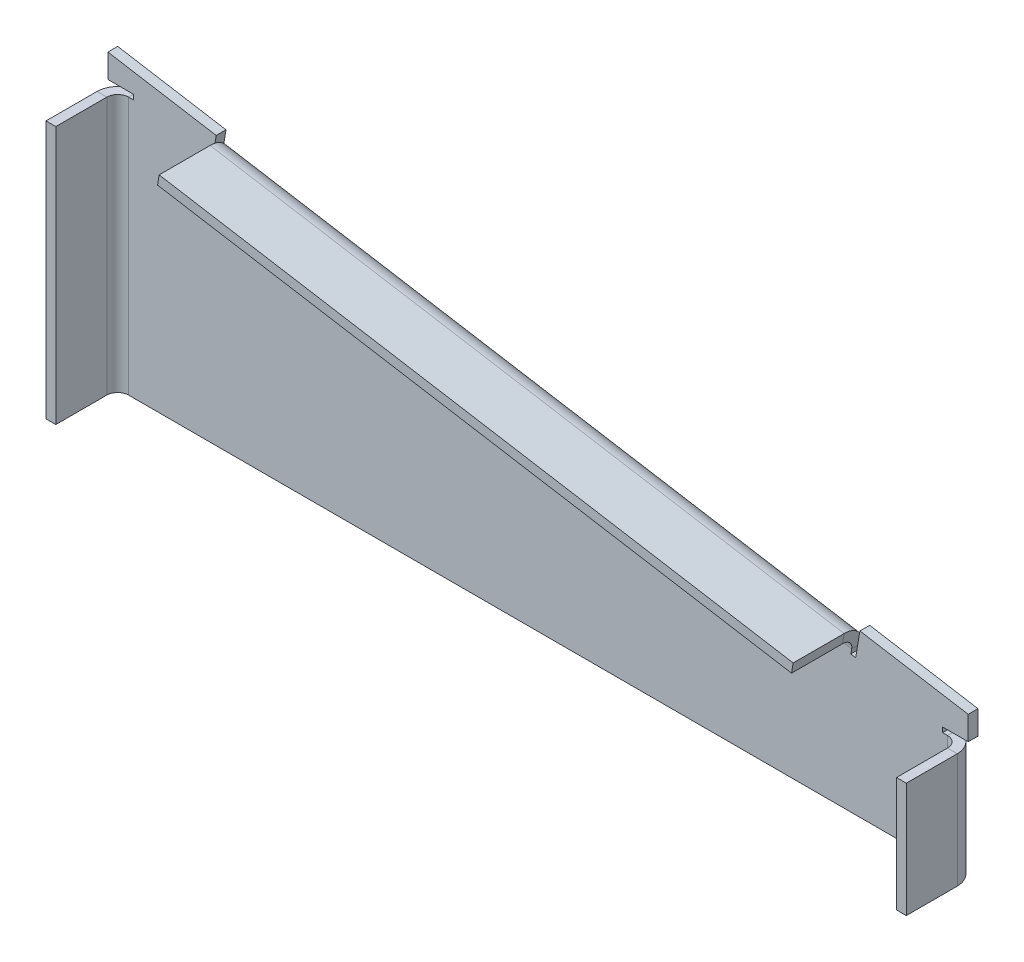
ISO-10303-21;
HEADER;
FILE_DESCRIPTION(('STEP AP214'),'2;1');
FILE_NAME('part.step','',(''),(''),'','','');
FILE_SCHEMA(('AUTOMOTIVE_DESIGN { 1 0 10303 214 1 1 1 1 }'));
ENDSEC;
DATA;
#1=APPLICATION_CONTEXT('core data for automotive mechanical design processes');
#2=APPLICATION_PROTOCOL_DEFINITION('international standard','automotive_design',2000,#1);
#3=PRODUCT_CONTEXT('',#1,'mechanical');
#4=PRODUCT('Part','Part','',(#3));
#5=PRODUCT_RELATED_PRODUCT_CATEGORY('part','',(#4));
#6=PRODUCT_DEFINITION_FORMATION('','',#4);
#7=PRODUCT_DEFINITION_CONTEXT('part definition',#1,'design');
#8=PRODUCT_DEFINITION('design','',#6,#7);
#9=PRODUCT_DEFINITION_SHAPE('','',#8);
#10=(LENGTH_UNIT() NAMED_UNIT(*) SI_UNIT(.MILLI.,.METRE.));
#11=(NAMED_UNIT(*) PLANE_ANGLE_UNIT() SI_UNIT($,.RADIAN.));
#12=(NAMED_UNIT(*) SI_UNIT($,.STERADIAN.) SOLID_ANGLE_UNIT());
#13=UNCERTAINTY_MEASURE_WITH_UNIT(LENGTH_MEASURE(1.E-05),#10,'distance_accuracy_value','');
#14=(GEOMETRIC_REPRESENTATION_CONTEXT(3) GLOBAL_UNCERTAINTY_ASSIGNED_CONTEXT((#13)) GLOBAL_UNIT_ASSIGNED_CONTEXT((#10,
#11,#12)) REPRESENTATION_CONTEXT('',''));
#15=CARTESIAN_POINT('',(0.,0.,0.));
#16=DIRECTION('',(0.,0.,1.));
#17=DIRECTION('',(1.,0.,0.));
#18=AXIS2_PLACEMENT_3D('',#15,#16,#17);
#19=CARTESIAN_POINT('',(0.,0.,3.4163));
#20=DIRECTION('',(0.,0.,-1.));
#21=DIRECTION('',(-1.,0.,0.));
#22=AXIS2_PLACEMENT_3D('',#19,#20,#21);
#23=PLANE('',#22);
#24=DIRECTION('',(-1.,0.,0.));
#25=VECTOR('',#24,1.);
#26=CARTESIAN_POINT('',(300.,41.70815,3.4163));
#27=LINE('',#26,#25);
#28=CARTESIAN_POINT('',(300.,41.70815,3.4163));
#29=VERTEX_POINT('',#28);
#30=CARTESIAN_POINT('',(291.06555,41.70815,3.4163));
#31=VERTEX_POINT('',#30);
#32=EDGE_CURVE('E474',#29,#31,#27,.T.);
#33=ORIENTED_EDGE('',*,*,#32,.F.);
#34=DIRECTION('',(0.,1.,0.));
#35=VECTOR('',#34,1.);
#36=CARTESIAN_POINT('',(300.,0.,3.4163));
#37=LINE('',#36,#35);
#38=CARTESIAN_POINT('',(300.,50.,3.4163));
#39=VERTEX_POINT('',#38);
#40=EDGE_CURVE('E552',#29,#39,#37,.T.);
#41=ORIENTED_EDGE('',*,*,#40,.T.);
#42=DIRECTION('',(-0.986393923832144,0.164398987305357,0.));
#43=VECTOR('',#42,1.);
#44=CARTESIAN_POINT('',(0.,100.,3.4163));
#45=LINE('',#44,#43);
#46=CARTESIAN_POINT('',(262.229151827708,56.2951413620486,3.4163));
#47=VERTEX_POINT('',#46);
#48=EDGE_CURVE('E555',#39,#47,#45,.T.);
#49=ORIENTED_EDGE('',*,*,#48,.T.);
#50=DIRECTION('',(0.164398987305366,0.986393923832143,0.));
#51=VECTOR('',#50,1.);
#52=CARTESIAN_POINT('',(260.760337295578,47.4822541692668,3.41630000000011));
#53=LINE('',#52,#51);
#54=CARTESIAN_POINT('',(260.760337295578,47.4822541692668,3.4163));
#55=VERTEX_POINT('',#54);
#56=EDGE_CURVE('E509',#55,#47,#53,.T.);
#57=ORIENTED_EDGE('',*,*,#56,.F.);
#58=DIRECTION('',(0.986393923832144,-0.164398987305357,0.));
#59=VECTOR('',#58,1.);
#60=CARTESIAN_POINT('',(259.075428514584,47.7630722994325,3.41630000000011));
#61=LINE('',#60,#59);
#62=CARTESIAN_POINT('',(259.075428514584,47.7630722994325,3.4163));
#63=VERTEX_POINT('',#62);
#64=EDGE_CURVE('E505',#63,#55,#61,.T.);
#65=ORIENTED_EDGE('',*,*,#64,.F.);
#66=DIRECTION('',(-0.164398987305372,-0.986393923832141,0.));
#67=VECTOR('',#66,1.);
#68=CARTESIAN_POINT('',(259.35624664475,49.4479810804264,3.41630000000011));
#69=LINE('',#68,#67);
#70=CARTESIAN_POINT('',(259.35624664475,49.4479810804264,3.41630000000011));
#71=VERTEX_POINT('',#70);
#72=EDGE_CURVE('E502',#71,#63,#69,.T.);
#73=ORIENTED_EDGE('',*,*,#72,.F.);
#74=DIRECTION('',(-0.986393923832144,0.164398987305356,0.));
#75=VECTOR('',#74,1.);
#76=CARTESIAN_POINT('',(38.267760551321,86.2960620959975,3.41630000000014));
#77=LINE('',#76,#75);
#78=CARTESIAN_POINT('',(38.267760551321,86.2960620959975,3.41630000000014));
#79=VERTEX_POINT('',#78);
#80=EDGE_CURVE('E411',#79,#71,#77,.F.);
#81=ORIENTED_EDGE('',*,*,#80,.F.);
#82=DIRECTION('',(0.164398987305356,0.986393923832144,0.));
#83=VECTOR('',#82,1.);
#84=CARTESIAN_POINT('',(37.9869424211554,84.6111533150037,3.41630000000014));
#85=LINE('',#84,#83);
#86=CARTESIAN_POINT('',(37.9869424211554,84.6111533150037,3.4163));
#87=VERTEX_POINT('',#86);
#88=EDGE_CURVE('E498',#87,#79,#85,.T.);
#89=ORIENTED_EDGE('',*,*,#88,.F.);
#90=DIRECTION('',(0.986393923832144,-0.164398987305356,0.));
#91=VECTOR('',#90,1.);
#92=CARTESIAN_POINT('',(36.3020336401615,84.8919714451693,3.41630000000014));
#93=LINE('',#92,#91);
#94=CARTESIAN_POINT('',(36.3020336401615,84.8919714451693,3.4163));
#95=VERTEX_POINT('',#94);
#96=EDGE_CURVE('E494',#95,#87,#93,.T.);
#97=ORIENTED_EDGE('',*,*,#96,.F.);
#98=DIRECTION('',(-0.164398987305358,-0.986393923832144,0.));
#99=VECTOR('',#98,1.);
#100=CARTESIAN_POINT('',(37.7708481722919,93.7048586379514,3.41630000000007));
#101=LINE('',#100,#99);
#102=CARTESIAN_POINT('',(37.7708481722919,93.7048586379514,3.4163));
#103=VERTEX_POINT('',#102);
#104=EDGE_CURVE('E489',#103,#95,#101,.T.);
#105=ORIENTED_EDGE('',*,*,#104,.F.);
#106=CARTESIAN_POINT('',(0.,100.,3.4163));
#107=VERTEX_POINT('',#106);
#108=EDGE_CURVE('E554',#103,#107,#45,.T.);
#109=ORIENTED_EDGE('',*,*,#108,.T.);
#110=DIRECTION('',(0.,-1.,0.));
#111=VECTOR('',#110,1.);
#112=CARTESIAN_POINT('',(0.,0.,3.4163));
#113=LINE('',#112,#111);
#114=CARTESIAN_POINT('',(0.,91.70815,3.4163));
#115=VERTEX_POINT('',#114);
#116=EDGE_CURVE('E545',#107,#115,#113,.T.);
#117=ORIENTED_EDGE('',*,*,#116,.T.);
#118=DIRECTION('',(-1.,0.,0.));
#119=VECTOR('',#118,1.);
#120=CARTESIAN_POINT('',(8.93444999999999,91.70815,3.4163));
#121=LINE('',#120,#119);
#122=CARTESIAN_POINT('',(8.93444999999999,91.70815,3.4163));
#123=VERTEX_POINT('',#122);
#124=EDGE_CURVE('E537',#123,#115,#121,.T.);
#125=ORIENTED_EDGE('',*,*,#124,.F.);
#126=DIRECTION('',(0.,1.,0.));
#127=VECTOR('',#126,1.);
#128=CARTESIAN_POINT('',(8.93444999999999,90.,3.4163));
#129=LINE('',#128,#127);
#130=CARTESIAN_POINT('',(8.93444999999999,90.,3.4163));
#131=VERTEX_POINT('',#130);
#132=EDGE_CURVE('E533',#131,#123,#129,.T.);
#133=ORIENTED_EDGE('',*,*,#132,.F.);
#134=DIRECTION('',(1.,0.,0.));
#135=VECTOR('',#134,1.);
#136=CARTESIAN_POINT('',(7.22629999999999,90.,3.4163));
#137=LINE('',#136,#135);
#138=CARTESIAN_POINT('',(7.22629999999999,90.,3.4163));
#139=VERTEX_POINT('',#138);
#140=EDGE_CURVE('E529',#139,#131,#137,.T.);
#141=ORIENTED_EDGE('',*,*,#140,.F.);
#142=DIRECTION('',(0.,-1.,0.));
#143=VECTOR('',#142,1.);
#144=CARTESIAN_POINT('',(7.22629999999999,0.,3.4163));
#145=LINE('',#144,#143);
#146=CARTESIAN_POINT('',(7.22629999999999,0.,3.4163));
#147=VERTEX_POINT('',#146);
#148=EDGE_CURVE('E464',#147,#139,#145,.F.);
#149=ORIENTED_EDGE('',*,*,#148,.F.);
#150=DIRECTION('',(1.,0.,0.));
#151=VECTOR('',#150,1.);
#152=CARTESIAN_POINT('',(0.,0.,3.4163));
#153=LINE('',#152,#151);
#154=CARTESIAN_POINT('',(292.7737,0.,3.41629999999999));
#155=VERTEX_POINT('',#154);
#156=EDGE_CURVE('E548',#147,#155,#153,.T.);
#157=ORIENTED_EDGE('',*,*,#156,.T.);
#158=DIRECTION('',(0.,1.,0.));
#159=VECTOR('',#158,1.);
#160=CARTESIAN_POINT('',(292.7737,40.,3.41629999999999));
#161=LINE('',#160,#159);
#162=CARTESIAN_POINT('',(292.7737,40.,3.41629999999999));
#163=VERTEX_POINT('',#162);
#164=EDGE_CURVE('E357',#163,#155,#161,.F.);
#165=ORIENTED_EDGE('',*,*,#164,.F.);
#166=DIRECTION('',(1.,0.,0.));
#167=VECTOR('',#166,1.);
#168=CARTESIAN_POINT('',(291.06555,40.,3.41629999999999));
#169=LINE('',#168,#167);
#170=CARTESIAN_POINT('',(291.06555,40.,3.4163));
#171=VERTEX_POINT('',#170);
#172=EDGE_CURVE('E114',#171,#163,#169,.T.);
#173=ORIENTED_EDGE('',*,*,#172,.F.);
#174=DIRECTION('',(0.,-1.,0.));
#175=VECTOR('',#174,1.);
#176=CARTESIAN_POINT('',(291.06555,41.70815,3.41629999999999));
#177=LINE('',#176,#175);
#178=EDGE_CURVE('E109',#31,#171,#177,.T.);
#179=ORIENTED_EDGE('',*,*,#178,.F.);
#180=EDGE_LOOP('',(#33,#41,#49,#57,#65,#73,#81,#89,#97,#105,#109,#117,#125,#133,#141,#149,#157,
#165,#173,#179));
#181=FACE_BOUND('',#180,.T.);
#182=ADVANCED_FACE('F94',(#181),#23,.F.);
#183=CARTESIAN_POINT('',(0.,0.,0.));
#184=DIRECTION('',(0.,0.,-1.));
#185=DIRECTION('',(-1.,0.,0.));
#186=AXIS2_PLACEMENT_3D('',#183,#184,#185);
#187=PLANE('',#186);
#188=DIRECTION('',(0.,1.,0.));
#189=VECTOR('',#188,1.);
#190=CARTESIAN_POINT('',(300.,0.,0.));
#191=LINE('',#190,#189);
#192=CARTESIAN_POINT('',(300.,41.70815,0.));
#193=VERTEX_POINT('',#192);
#194=CARTESIAN_POINT('',(300.,50.,0.));
#195=VERTEX_POINT('',#194);
#196=EDGE_CURVE('E564',#193,#195,#191,.T.);
#197=ORIENTED_EDGE('',*,*,#196,.F.);
#198=DIRECTION('',(-1.,0.,0.));
#199=VECTOR('',#198,1.);
#200=CARTESIAN_POINT('',(0.,41.70815,0.));
#201=LINE('',#200,#199);
#202=CARTESIAN_POINT('',(291.06555,41.70815,0.));
#203=VERTEX_POINT('',#202);
#204=EDGE_CURVE('E477',#193,#203,#201,.T.);
#205=ORIENTED_EDGE('',*,*,#204,.T.);
#206=DIRECTION('',(0.,-1.,0.));
#207=VECTOR('',#206,1.);
#208=CARTESIAN_POINT('',(291.06555,0.,0.));
#209=LINE('',#208,#207);
#210=CARTESIAN_POINT('',(291.06555,40.,0.));
#211=VERTEX_POINT('',#210);
#212=EDGE_CURVE('E13',#203,#211,#209,.T.);
#213=ORIENTED_EDGE('',*,*,#212,.T.);
#214=DIRECTION('',(1.,0.,0.));
#215=VECTOR('',#214,1.);
#216=CARTESIAN_POINT('',(0.,40.,0.));
#217=LINE('',#216,#215);
#218=CARTESIAN_POINT('',(292.7737,40.,0.));
#219=VERTEX_POINT('',#218);
#220=EDGE_CURVE('E102',#211,#219,#217,.T.);
#221=ORIENTED_EDGE('',*,*,#220,.T.);
#222=DIRECTION('',(0.,1.,0.));
#223=VECTOR('',#222,1.);
#224=CARTESIAN_POINT('',(292.7737,40.,0.));
#225=LINE('',#224,#223);
#226=CARTESIAN_POINT('',(292.7737,0.,0.));
#227=VERTEX_POINT('',#226);
#228=EDGE_CURVE('E344',#219,#227,#225,.F.);
#229=ORIENTED_EDGE('',*,*,#228,.T.);
#230=DIRECTION('',(1.,0.,0.));
#231=VECTOR('',#230,1.);
#232=CARTESIAN_POINT('',(0.,0.,0.));
#233=LINE('',#232,#231);
#234=CARTESIAN_POINT('',(7.22629999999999,0.,0.));
#235=VERTEX_POINT('',#234);
#236=EDGE_CURVE('E561',#235,#227,#233,.T.);
#237=ORIENTED_EDGE('',*,*,#236,.F.);
#238=DIRECTION('',(0.,-1.,0.));
#239=VECTOR('',#238,1.);
#240=CARTESIAN_POINT('',(7.22629999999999,0.,0.));
#241=LINE('',#240,#239);
#242=CARTESIAN_POINT('',(7.22629999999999,90.,0.));
#243=VERTEX_POINT('',#242);
#244=EDGE_CURVE('E451',#235,#243,#241,.F.);
#245=ORIENTED_EDGE('',*,*,#244,.T.);
#246=DIRECTION('',(1.,0.,0.));
#247=VECTOR('',#246,1.);
#248=CARTESIAN_POINT('',(0.,90.,0.));
#249=LINE('',#248,#247);
#250=CARTESIAN_POINT('',(8.93444999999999,90.,0.));
#251=VERTEX_POINT('',#250);
#252=EDGE_CURVE('E579',#243,#251,#249,.T.);
#253=ORIENTED_EDGE('',*,*,#252,.T.);
#254=DIRECTION('',(0.,1.,0.));
#255=VECTOR('',#254,1.);
#256=CARTESIAN_POINT('',(8.93444999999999,0.,0.));
#257=LINE('',#256,#255);
#258=CARTESIAN_POINT('',(8.93444999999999,91.70815,0.));
#259=VERTEX_POINT('',#258);
#260=EDGE_CURVE('E576',#251,#259,#257,.T.);
#261=ORIENTED_EDGE('',*,*,#260,.T.);
#262=DIRECTION('',(-1.,0.,0.));
#263=VECTOR('',#262,1.);
#264=CARTESIAN_POINT('',(0.,91.70815,0.));
#265=LINE('',#264,#263);
#266=CARTESIAN_POINT('',(0.,91.70815,0.));
#267=VERTEX_POINT('',#266);
#268=EDGE_CURVE('E573',#259,#267,#265,.T.);
#269=ORIENTED_EDGE('',*,*,#268,.T.);
#270=DIRECTION('',(0.,-1.,0.));
#271=VECTOR('',#270,1.);
#272=CARTESIAN_POINT('',(0.,0.,0.));
#273=LINE('',#272,#271);
#274=CARTESIAN_POINT('',(0.,100.,0.));
#275=VERTEX_POINT('',#274);
#276=EDGE_CURVE('E532',#275,#267,#273,.T.);
#277=ORIENTED_EDGE('',*,*,#276,.F.);
#278=DIRECTION('',(-0.986393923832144,0.164398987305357,0.));
#279=VECTOR('',#278,1.);
#280=CARTESIAN_POINT('',(0.,100.,0.));
#281=LINE('',#280,#279);
#282=CARTESIAN_POINT('',(37.7708481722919,93.7048586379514,0.));
#283=VERTEX_POINT('',#282);
#284=EDGE_CURVE('E566',#283,#275,#281,.T.);
#285=ORIENTED_EDGE('',*,*,#284,.F.);
#286=DIRECTION('',(-0.164398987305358,-0.986393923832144,0.));
#287=VECTOR('',#286,1.);
#288=CARTESIAN_POINT('',(21.5546319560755,-3.59243865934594,0.));
#289=LINE('',#288,#287);
#290=CARTESIAN_POINT('',(36.3020336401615,84.8919714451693,0.));
#291=VERTEX_POINT('',#290);
#292=EDGE_CURVE('E526',#283,#291,#289,.T.);
#293=ORIENTED_EDGE('',*,*,#292,.T.);
#294=DIRECTION('',(0.986393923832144,-0.164398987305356,0.));
#295=VECTOR('',#294,1.);
#296=CARTESIAN_POINT('',(14.7474016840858,88.4844101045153,0.));
#297=LINE('',#296,#295);
#298=CARTESIAN_POINT('',(37.9869424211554,84.6111533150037,0.));
#299=VERTEX_POINT('',#298);
#300=EDGE_CURVE('E589',#291,#299,#297,.T.);
#301=ORIENTED_EDGE('',*,*,#300,.T.);
#302=DIRECTION('',(0.164398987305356,0.986393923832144,0.));
#303=VECTOR('',#302,1.);
#304=CARTESIAN_POINT('',(23.2395407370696,-3.87325678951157,0.));
#305=LINE('',#304,#303);
#306=CARTESIAN_POINT('',(38.267760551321,86.2960620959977,1.37043154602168E-13));
#307=VERTEX_POINT('',#306);
#308=EDGE_CURVE('E586',#299,#307,#305,.T.);
#309=ORIENTED_EDGE('',*,*,#308,.T.);
#310=DIRECTION('',(-0.986393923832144,0.164398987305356,0.));
#311=VECTOR('',#310,1.);
#312=CARTESIAN_POINT('',(38.267760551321,86.2960620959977,1.37043154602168E-13));
#313=LINE('',#312,#311);
#314=CARTESIAN_POINT('',(259.35624664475,49.4479810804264,0.));
#315=VERTEX_POINT('',#314);
#316=EDGE_CURVE('E398',#307,#315,#313,.F.);
#317=ORIENTED_EDGE('',*,*,#316,.T.);
#318=DIRECTION('',(-0.164398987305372,-0.986393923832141,0.));
#319=VECTOR('',#318,1.);
#320=CARTESIAN_POINT('',(244.328026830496,-40.7213378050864,0.));
#321=LINE('',#320,#319);
#322=CARTESIAN_POINT('',(259.075428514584,47.7630722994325,0.));
#323=VERTEX_POINT('',#322);
#324=EDGE_CURVE('E584',#315,#323,#321,.T.);
#325=ORIENTED_EDGE('',*,*,#324,.T.);
#326=DIRECTION('',(0.986393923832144,-0.164398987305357,0.));
#327=VECTOR('',#326,1.);
#328=CARTESIAN_POINT('',(14.7474016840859,88.4844101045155,0.));
#329=LINE('',#328,#327);
#330=CARTESIAN_POINT('',(260.760337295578,47.4822541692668,0.));
#331=VERTEX_POINT('',#330);
#332=EDGE_CURVE('E582',#323,#331,#329,.T.);
#333=ORIENTED_EDGE('',*,*,#332,.T.);
#334=DIRECTION('',(0.164398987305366,0.986393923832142,0.));
#335=VECTOR('',#334,1.);
#336=CARTESIAN_POINT('',(246.012935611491,-41.0021559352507,0.));
#337=LINE('',#336,#335);
#338=CARTESIAN_POINT('',(262.229151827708,56.2951413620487,0.));
#339=VERTEX_POINT('',#338);
#340=EDGE_CURVE('E492',#331,#339,#337,.T.);
#341=ORIENTED_EDGE('',*,*,#340,.T.);
#342=EDGE_CURVE('E549',#195,#339,#281,.T.);
#343=ORIENTED_EDGE('',*,*,#342,.F.);
#344=EDGE_LOOP('',(#197,#205,#213,#221,#229,#237,#245,#253,#261,#269,#277,#285,#293,#301,#309,
#317,#325,#333,#341,#343));
#345=FACE_BOUND('',#344,.T.);
#346=ADVANCED_FACE('F594',(#345),#187,.T.);
#347=CARTESIAN_POINT('',(0.,0.,3.4163));
#348=DIRECTION('',(0.,1.,0.));
#349=DIRECTION('',(0.,0.,1.));
#350=AXIS2_PLACEMENT_3D('',#347,#348,#349);
#351=PLANE('',#350);
#352=DIRECTION('',(0.,0.,-1.));
#353=VECTOR('',#352,1.);
#354=CARTESIAN_POINT('',(292.7737,0.,3.41629999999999));
#355=LINE('',#354,#353);
#356=EDGE_CURVE('E362',#155,#227,#355,.T.);
#357=ORIENTED_EDGE('',*,*,#356,.F.);
#358=ORIENTED_EDGE('',*,*,#156,.F.);
#359=DIRECTION('',(0.,0.,-1.));
#360=VECTOR('',#359,1.);
#361=CARTESIAN_POINT('',(7.22629999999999,0.,3.4163));
#362=LINE('',#361,#360);
#363=EDGE_CURVE('E458',#147,#235,#362,.T.);
#364=ORIENTED_EDGE('',*,*,#363,.T.);
#365=ORIENTED_EDGE('',*,*,#236,.T.);
#366=EDGE_LOOP('',(#357,#358,#364,#365));
#367=FACE_BOUND('',#366,.T.);
#368=ADVANCED_FACE('F612',(#367),#351,.F.);
#369=CARTESIAN_POINT('',(300.,0.,3.4163));
#370=DIRECTION('',(-1.,0.,0.));
#371=DIRECTION('',(0.,0.,1.));
#372=AXIS2_PLACEMENT_3D('',#369,#370,#371);
#373=PLANE('',#372);
#374=DIRECTION('',(0.,0.,-1.));
#375=VECTOR('',#374,1.);
#376=CARTESIAN_POINT('',(300.,41.70815,3.4163));
#377=LINE('',#376,#375);
#378=EDGE_CURVE('E478',#29,#193,#377,.T.);
#379=ORIENTED_EDGE('',*,*,#378,.T.);
#380=ORIENTED_EDGE('',*,*,#196,.T.);
#381=DIRECTION('',(0.,0.,-1.));
#382=VECTOR('',#381,1.);
#383=CARTESIAN_POINT('',(300.,50.,3.4163));
#384=LINE('',#383,#382);
#385=EDGE_CURVE('E570',#39,#195,#384,.T.);
#386=ORIENTED_EDGE('',*,*,#385,.F.);
#387=ORIENTED_EDGE('',*,*,#40,.F.);
#388=EDGE_LOOP('',(#379,#380,#386,#387));
#389=FACE_BOUND('',#388,.T.);
#390=ADVANCED_FACE('F646',(#389),#373,.F.);
#391=CARTESIAN_POINT('',(0.,100.,3.4163));
#392=DIRECTION('',(-0.164398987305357,-0.986393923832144,0.));
#393=DIRECTION('',(0.986393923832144,-0.164398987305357,0.));
#394=AXIS2_PLACEMENT_3D('',#391,#392,#393);
#395=PLANE('',#394);
#396=DIRECTION('',(0.,0.,-1.));
#397=VECTOR('',#396,1.);
#398=CARTESIAN_POINT('',(37.7708481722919,93.7048586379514,3.41630000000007));
#399=LINE('',#398,#397);
#400=EDGE_CURVE('E493',#103,#283,#399,.T.);
#401=ORIENTED_EDGE('',*,*,#400,.T.);
#402=ORIENTED_EDGE('',*,*,#284,.T.);
#403=DIRECTION('',(0.,0.,-1.));
#404=VECTOR('',#403,1.);
#405=CARTESIAN_POINT('',(0.,100.,3.4163));
#406=LINE('',#405,#404);
#407=EDGE_CURVE('E558',#107,#275,#406,.T.);
#408=ORIENTED_EDGE('',*,*,#407,.F.);
#409=ORIENTED_EDGE('',*,*,#108,.F.);
#410=EDGE_LOOP('',(#401,#402,#408,#409));
#411=FACE_BOUND('',#410,.T.);
#412=ADVANCED_FACE('F642',(#411),#395,.F.);
#413=DIRECTION('',(0.,0.,-1.));
#414=VECTOR('',#413,1.);
#415=CARTESIAN_POINT('',(262.229151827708,56.2951413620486,3.41630000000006));
#416=LINE('',#415,#414);
#417=EDGE_CURVE('E512',#47,#339,#416,.T.);
#418=ORIENTED_EDGE('',*,*,#417,.F.);
#419=ORIENTED_EDGE('',*,*,#48,.F.);
#420=ORIENTED_EDGE('',*,*,#385,.T.);
#421=ORIENTED_EDGE('',*,*,#342,.T.);
#422=EDGE_LOOP('',(#418,#419,#420,#421));
#423=FACE_BOUND('',#422,.T.);
#424=ADVANCED_FACE('F645',(#423),#395,.F.);
#425=CARTESIAN_POINT('',(0.,0.,3.4163));
#426=DIRECTION('',(1.,0.,0.));
#427=DIRECTION('',(0.,0.,-1.));
#428=AXIS2_PLACEMENT_3D('',#425,#426,#427);
#429=PLANE('',#428);
#430=DIRECTION('',(0.,0.,-1.));
#431=VECTOR('',#430,1.);
#432=CARTESIAN_POINT('',(0.,91.70815,3.4163));
#433=LINE('',#432,#431);
#434=EDGE_CURVE('E539',#115,#267,#433,.T.);
#435=ORIENTED_EDGE('',*,*,#434,.F.);
#436=ORIENTED_EDGE('',*,*,#116,.F.);
#437=ORIENTED_EDGE('',*,*,#407,.T.);
#438=ORIENTED_EDGE('',*,*,#276,.T.);
#439=EDGE_LOOP('',(#435,#436,#437,#438));
#440=FACE_BOUND('',#439,.T.);
#441=ADVANCED_FACE('F96',(#440),#429,.F.);
#442=CARTESIAN_POINT('',(7.22629999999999,90.,3.4163));
#443=DIRECTION('',(0.,1.,0.));
#444=DIRECTION('',(0.,0.,1.));
#445=AXIS2_PLACEMENT_3D('',#442,#443,#444);
#446=PLANE('',#445);
#447=ORIENTED_EDGE('',*,*,#252,.F.);
#448=DIRECTION('',(0.,0.,-1.));
#449=VECTOR('',#448,1.);
#450=CARTESIAN_POINT('',(7.22629999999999,90.,3.4163));
#451=LINE('',#450,#449);
#452=EDGE_CURVE('E468',#139,#243,#451,.T.);
#453=ORIENTED_EDGE('',*,*,#452,.F.);
#454=ORIENTED_EDGE('',*,*,#140,.T.);
#455=DIRECTION('',(0.,0.,-1.));
#456=VECTOR('',#455,1.);
#457=CARTESIAN_POINT('',(8.93444999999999,90.,3.4163));
#458=LINE('',#457,#456);
#459=EDGE_CURVE('E536',#131,#251,#458,.T.);
#460=ORIENTED_EDGE('',*,*,#459,.T.);
#461=EDGE_LOOP('',(#447,#453,#454,#460));
#462=FACE_BOUND('',#461,.T.);
#463=ADVANCED_FACE('F639',(#462),#446,.T.);
#464=CARTESIAN_POINT('',(8.93444999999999,90.,3.4163));
#465=DIRECTION('',(-1.,0.,0.));
#466=DIRECTION('',(0.,0.,1.));
#467=AXIS2_PLACEMENT_3D('',#464,#465,#466);
#468=PLANE('',#467);
#469=ORIENTED_EDGE('',*,*,#260,.F.);
#470=ORIENTED_EDGE('',*,*,#459,.F.);
#471=ORIENTED_EDGE('',*,*,#132,.T.);
#472=DIRECTION('',(0.,0.,-1.));
#473=VECTOR('',#472,1.);
#474=CARTESIAN_POINT('',(8.93444999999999,91.70815,3.4163));
#475=LINE('',#474,#473);
#476=EDGE_CURVE('E528',#123,#259,#475,.T.);
#477=ORIENTED_EDGE('',*,*,#476,.T.);
#478=EDGE_LOOP('',(#469,#470,#471,#477));
#479=FACE_BOUND('',#478,.T.);
#480=ADVANCED_FACE('F681',(#479),#468,.T.);
#481=CARTESIAN_POINT('',(8.93444999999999,91.70815,3.4163));
#482=DIRECTION('',(0.,-1.,0.));
#483=DIRECTION('',(0.,0.,-1.));
#484=AXIS2_PLACEMENT_3D('',#481,#482,#483);
#485=PLANE('',#484);
#486=ORIENTED_EDGE('',*,*,#268,.F.);
#487=ORIENTED_EDGE('',*,*,#476,.F.);
#488=ORIENTED_EDGE('',*,*,#124,.T.);
#489=ORIENTED_EDGE('',*,*,#434,.T.);
#490=EDGE_LOOP('',(#486,#487,#488,#489));
#491=FACE_BOUND('',#490,.T.);
#492=ADVANCED_FACE('F688',(#491),#485,.T.);
#493=CARTESIAN_POINT('',(37.7708481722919,93.7048586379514,3.41630000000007));
#494=DIRECTION('',(0.986393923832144,-0.164398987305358,0.));
#495=DIRECTION('',(0.164398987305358,0.986393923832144,0.));
#496=AXIS2_PLACEMENT_3D('',#493,#494,#495);
#497=PLANE('',#496);
#498=ORIENTED_EDGE('',*,*,#292,.F.);
#499=ORIENTED_EDGE('',*,*,#400,.F.);
#500=ORIENTED_EDGE('',*,*,#104,.T.);
#501=DIRECTION('',(0.,0.,-1.));
#502=VECTOR('',#501,1.);
#503=CARTESIAN_POINT('',(36.3020336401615,84.8919714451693,3.41630000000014));
#504=LINE('',#503,#502);
#505=EDGE_CURVE('E497',#95,#291,#504,.T.);
#506=ORIENTED_EDGE('',*,*,#505,.T.);
#507=EDGE_LOOP('',(#498,#499,#500,#506));
#508=FACE_BOUND('',#507,.T.);
#509=ADVANCED_FACE('F695',(#508),#497,.T.);
#510=CARTESIAN_POINT('',(36.3020336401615,84.8919714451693,3.41630000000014));
#511=DIRECTION('',(0.164398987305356,0.986393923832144,0.));
#512=DIRECTION('',(-0.986393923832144,0.164398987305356,0.));
#513=AXIS2_PLACEMENT_3D('',#510,#511,#512);
#514=PLANE('',#513);
#515=ORIENTED_EDGE('',*,*,#300,.F.);
#516=ORIENTED_EDGE('',*,*,#505,.F.);
#517=ORIENTED_EDGE('',*,*,#96,.T.);
#518=DIRECTION('',(0.,0.,-1.));
#519=VECTOR('',#518,1.);
#520=CARTESIAN_POINT('',(37.9869424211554,84.6111533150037,3.41630000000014));
#521=LINE('',#520,#519);
#522=EDGE_CURVE('E501',#87,#299,#521,.T.);
#523=ORIENTED_EDGE('',*,*,#522,.T.);
#524=EDGE_LOOP('',(#515,#516,#517,#523));
#525=FACE_BOUND('',#524,.T.);
#526=ADVANCED_FACE('F703',(#525),#514,.T.);
#527=CARTESIAN_POINT('',(37.9869424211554,84.6111533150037,3.41630000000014));
#528=DIRECTION('',(-0.986393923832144,0.164398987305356,0.));
#529=DIRECTION('',(-0.164398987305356,-0.986393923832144,0.));
#530=AXIS2_PLACEMENT_3D('',#527,#528,#529);
#531=PLANE('',#530);
#532=ORIENTED_EDGE('',*,*,#308,.F.);
#533=ORIENTED_EDGE('',*,*,#522,.F.);
#534=ORIENTED_EDGE('',*,*,#88,.T.);
#535=DIRECTION('',(0.,0.,-1.));
#536=VECTOR('',#535,1.);
#537=CARTESIAN_POINT('',(38.267760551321,86.2960620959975,3.41630000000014));
#538=LINE('',#537,#536);
#539=EDGE_CURVE('E405',#79,#307,#538,.T.);
#540=ORIENTED_EDGE('',*,*,#539,.T.);
#541=EDGE_LOOP('',(#532,#533,#534,#540));
#542=FACE_BOUND('',#541,.T.);
#543=ADVANCED_FACE('F711',(#542),#531,.T.);
#544=CARTESIAN_POINT('',(259.35624664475,49.4479810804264,3.41630000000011));
#545=DIRECTION('',(0.986393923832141,-0.164398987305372,0.));
#546=DIRECTION('',(0.164398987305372,0.986393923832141,0.));
#547=AXIS2_PLACEMENT_3D('',#544,#545,#546);
#548=PLANE('',#547);
#549=ORIENTED_EDGE('',*,*,#324,.F.);
#550=DIRECTION('',(0.,0.,-1.));
#551=VECTOR('',#550,1.);
#552=CARTESIAN_POINT('',(259.35624664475,49.4479810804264,3.41630000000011));
#553=LINE('',#552,#551);
#554=EDGE_CURVE('E415',#71,#315,#553,.T.);
#555=ORIENTED_EDGE('',*,*,#554,.F.);
#556=ORIENTED_EDGE('',*,*,#72,.T.);
#557=DIRECTION('',(0.,0.,-1.));
#558=VECTOR('',#557,1.);
#559=CARTESIAN_POINT('',(259.075428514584,47.7630722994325,3.41630000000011));
#560=LINE('',#559,#558);
#561=EDGE_CURVE('E508',#63,#323,#560,.T.);
#562=ORIENTED_EDGE('',*,*,#561,.T.);
#563=EDGE_LOOP('',(#549,#555,#556,#562));
#564=FACE_BOUND('',#563,.T.);
#565=ADVANCED_FACE('F719',(#564),#548,.T.);
#566=CARTESIAN_POINT('',(259.075428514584,47.7630722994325,3.41630000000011));
#567=DIRECTION('',(0.164398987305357,0.986393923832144,0.));
#568=DIRECTION('',(-0.986393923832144,0.164398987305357,0.));
#569=AXIS2_PLACEMENT_3D('',#566,#567,#568);
#570=PLANE('',#569);
#571=ORIENTED_EDGE('',*,*,#332,.F.);
#572=ORIENTED_EDGE('',*,*,#561,.F.);
#573=ORIENTED_EDGE('',*,*,#64,.T.);
#574=DIRECTION('',(0.,0.,-1.));
#575=VECTOR('',#574,1.);
#576=CARTESIAN_POINT('',(260.760337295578,47.4822541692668,3.41630000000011));
#577=LINE('',#576,#575);
#578=EDGE_CURVE('E488',#55,#331,#577,.T.);
#579=ORIENTED_EDGE('',*,*,#578,.T.);
#580=EDGE_LOOP('',(#571,#572,#573,#579));
#581=FACE_BOUND('',#580,.T.);
#582=ADVANCED_FACE('F727',(#581),#570,.T.);
#583=CARTESIAN_POINT('',(260.760337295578,47.4822541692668,3.41630000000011));
#584=DIRECTION('',(-0.986393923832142,0.164398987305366,0.));
#585=DIRECTION('',(-0.164398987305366,-0.986393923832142,0.));
#586=AXIS2_PLACEMENT_3D('',#583,#584,#585);
#587=PLANE('',#586);
#588=ORIENTED_EDGE('',*,*,#340,.F.);
#589=ORIENTED_EDGE('',*,*,#578,.F.);
#590=ORIENTED_EDGE('',*,*,#56,.T.);
#591=ORIENTED_EDGE('',*,*,#417,.T.);
#592=EDGE_LOOP('',(#588,#589,#590,#591));
#593=FACE_BOUND('',#592,.T.);
#594=ADVANCED_FACE('F735',(#593),#587,.T.);
#595=CARTESIAN_POINT('',(300.,41.70815,3.4163));
#596=DIRECTION('',(0.,-1.,0.));
#597=DIRECTION('',(0.,0.,-1.));
#598=AXIS2_PLACEMENT_3D('',#595,#596,#597);
#599=PLANE('',#598);
#600=ORIENTED_EDGE('',*,*,#204,.F.);
#601=ORIENTED_EDGE('',*,*,#378,.F.);
#602=ORIENTED_EDGE('',*,*,#32,.T.);
#603=DIRECTION('',(0.,0.,-1.));
#604=VECTOR('',#603,1.);
#605=CARTESIAN_POINT('',(291.06555,41.70815,3.41629999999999));
#606=LINE('',#605,#604);
#607=EDGE_CURVE('E480',#31,#203,#606,.T.);
#608=ORIENTED_EDGE('',*,*,#607,.T.);
#609=EDGE_LOOP('',(#600,#601,#602,#608));
#610=FACE_BOUND('',#609,.T.);
#611=ADVANCED_FACE('F743',(#610),#599,.T.);
#612=CARTESIAN_POINT('',(291.06555,41.70815,3.41629999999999));
#613=DIRECTION('',(1.,0.,0.));
#614=DIRECTION('',(0.,0.,-1.));
#615=AXIS2_PLACEMENT_3D('',#612,#613,#614);
#616=PLANE('',#615);
#617=ORIENTED_EDGE('',*,*,#212,.F.);
#618=ORIENTED_EDGE('',*,*,#607,.F.);
#619=ORIENTED_EDGE('',*,*,#178,.T.);
#620=DIRECTION('',(0.,0.,-1.));
#621=VECTOR('',#620,1.);
#622=CARTESIAN_POINT('',(291.06555,40.,3.41629999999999));
#623=LINE('',#622,#621);
#624=EDGE_CURVE('E471',#171,#211,#623,.T.);
#625=ORIENTED_EDGE('',*,*,#624,.T.);
#626=EDGE_LOOP('',(#617,#618,#619,#625));
#627=FACE_BOUND('',#626,.T.);
#628=ADVANCED_FACE('F751',(#627),#616,.T.);
#629=CARTESIAN_POINT('',(291.06555,40.,3.41629999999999));
#630=DIRECTION('',(0.,1.,0.));
#631=DIRECTION('',(0.,0.,1.));
#632=AXIS2_PLACEMENT_3D('',#629,#630,#631);
#633=PLANE('',#632);
#634=ORIENTED_EDGE('',*,*,#220,.F.);
#635=ORIENTED_EDGE('',*,*,#624,.F.);
#636=ORIENTED_EDGE('',*,*,#172,.T.);
#637=DIRECTION('',(0.,0.,-1.));
#638=VECTOR('',#637,1.);
#639=CARTESIAN_POINT('',(292.7737,40.,3.41629999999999));
#640=LINE('',#639,#638);
#641=EDGE_CURVE('E351',#163,#219,#640,.T.);
#642=ORIENTED_EDGE('',*,*,#641,.T.);
#643=EDGE_LOOP('',(#634,#635,#636,#642));
#644=FACE_BOUND('',#643,.T.);
#645=ADVANCED_FACE('F598',(#644),#633,.T.);
#646=CARTESIAN_POINT('',(7.22629999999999,90.,7.2263));
#647=DIRECTION('',(0.,1.,0.));
#648=DIRECTION('',(0.,0.,1.));
#649=AXIS2_PLACEMENT_3D('',#646,#647,#648);
#650=PLANE('',#649);
#651=DIRECTION('',(1.,0.,0.));
#652=VECTOR('',#651,1.);
#653=CARTESIAN_POINT('',(0.,90.,7.22629999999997));
#654=LINE('',#653,#652);
#655=CARTESIAN_POINT('',(3.41629999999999,90.,7.22629999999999));
#656=VERTEX_POINT('',#655);
#657=CARTESIAN_POINT('',(0.,90.,7.22629999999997));
#658=VERTEX_POINT('',#657);
#659=EDGE_CURVE('E418',#656,#658,#654,.F.);
#660=ORIENTED_EDGE('',*,*,#659,.F.);
#661=CARTESIAN_POINT('',(7.22629999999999,90.,7.2263));
#662=DIRECTION('',(0.,-1.,0.));
#663=DIRECTION('',(0.,0.,-1.));
#664=AXIS2_PLACEMENT_3D('',#661,#662,#663);
#665=CIRCLE('',#664,3.81);
#666=EDGE_CURVE('E461',#139,#656,#665,.F.);
#667=ORIENTED_EDGE('',*,*,#666,.F.);
#668=ORIENTED_EDGE('',*,*,#452,.T.);
#669=CARTESIAN_POINT('',(7.22629999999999,90.,7.2263));
#670=DIRECTION('',(0.,-1.,0.));
#671=DIRECTION('',(0.,0.,-1.));
#672=AXIS2_PLACEMENT_3D('',#669,#670,#671);
#673=CIRCLE('',#672,7.2263);
#674=EDGE_CURVE('E454',#243,#658,#673,.F.);
#675=ORIENTED_EDGE('',*,*,#674,.T.);
#676=EDGE_LOOP('',(#660,#667,#668,#675));
#677=FACE_BOUND('',#676,.T.);
#678=ADVANCED_FACE('F766',(#677),#650,.T.);
#679=CARTESIAN_POINT('',(7.22629999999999,0.,7.2263));
#680=DIRECTION('',(0.,1.,0.));
#681=DIRECTION('',(0.,0.,1.));
#682=AXIS2_PLACEMENT_3D('',#679,#680,#681);
#683=PLANE('',#682);
#684=CARTESIAN_POINT('',(7.22629999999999,0.,7.2263));
#685=DIRECTION('',(0.,-1.,0.));
#686=DIRECTION('',(0.,0.,-1.));
#687=AXIS2_PLACEMENT_3D('',#684,#685,#686);
#688=CIRCLE('',#687,3.81);
#689=CARTESIAN_POINT('',(3.41629999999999,0.,7.22629999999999));
#690=VERTEX_POINT('',#689);
#691=EDGE_CURVE('E424',#690,#147,#688,.T.);
#692=ORIENTED_EDGE('',*,*,#691,.F.);
#693=DIRECTION('',(1.,0.,0.));
#694=VECTOR('',#693,1.);
#695=CARTESIAN_POINT('',(3.41629999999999,0.,7.22629999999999));
#696=LINE('',#695,#694);
#697=CARTESIAN_POINT('',(0.,0.,7.22629999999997));
#698=VERTEX_POINT('',#697);
#699=EDGE_CURVE('E444',#690,#698,#696,.F.);
#700=ORIENTED_EDGE('',*,*,#699,.T.);
#701=CARTESIAN_POINT('',(7.22629999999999,0.,7.2263));
#702=DIRECTION('',(0.,-1.,0.));
#703=DIRECTION('',(0.,0.,-1.));
#704=AXIS2_PLACEMENT_3D('',#701,#702,#703);
#705=CIRCLE('',#704,7.2263);
#706=EDGE_CURVE('E455',#698,#235,#705,.T.);
#707=ORIENTED_EDGE('',*,*,#706,.T.);
#708=ORIENTED_EDGE('',*,*,#363,.F.);
#709=EDGE_LOOP('',(#692,#700,#707,#708));
#710=FACE_BOUND('',#709,.T.);
#711=ADVANCED_FACE('F773',(#710),#683,.F.);
#712=CARTESIAN_POINT('',(7.22629999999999,0.,7.2263));
#713=DIRECTION('',(0.,-1.,0.));
#714=DIRECTION('',(-1.,0.,0.));
#715=AXIS2_PLACEMENT_3D('',#712,#713,#714);
#716=CYLINDRICAL_SURFACE('',#715,7.2263);
#717=ORIENTED_EDGE('',*,*,#244,.F.);
#718=ORIENTED_EDGE('',*,*,#706,.F.);
#719=DIRECTION('',(0.,-1.,0.));
#720=VECTOR('',#719,1.);
#721=CARTESIAN_POINT('',(0.,90.,7.22629999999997));
#722=LINE('',#721,#720);
#723=EDGE_CURVE('E442',#698,#658,#722,.F.);
#724=ORIENTED_EDGE('',*,*,#723,.T.);
#725=ORIENTED_EDGE('',*,*,#674,.F.);
#726=EDGE_LOOP('',(#717,#718,#724,#725));
#727=FACE_BOUND('',#726,.T.);
#728=ADVANCED_FACE('F781',(#727),#716,.T.);
#729=CARTESIAN_POINT('',(7.22629999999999,0.,7.2263));
#730=DIRECTION('',(0.,-1.,0.));
#731=DIRECTION('',(-1.,0.,0.));
#732=AXIS2_PLACEMENT_3D('',#729,#730,#731);
#733=CYLINDRICAL_SURFACE('',#732,3.81);
#734=ORIENTED_EDGE('',*,*,#148,.T.);
#735=ORIENTED_EDGE('',*,*,#666,.T.);
#736=DIRECTION('',(0.,-1.,0.));
#737=VECTOR('',#736,1.);
#738=CARTESIAN_POINT('',(3.41629999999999,90.,7.22629999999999));
#739=LINE('',#738,#737);
#740=EDGE_CURVE('E447',#656,#690,#739,.T.);
#741=ORIENTED_EDGE('',*,*,#740,.T.);
#742=ORIENTED_EDGE('',*,*,#691,.T.);
#743=EDGE_LOOP('',(#734,#735,#741,#742));
#744=FACE_BOUND('',#743,.T.);
#745=ADVANCED_FACE('F789',(#744),#733,.F.);
#746=CARTESIAN_POINT('',(0.,90.,3.41629999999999));
#747=DIRECTION('',(0.,-1.,0.));
#748=DIRECTION('',(0.,0.,-1.));
#749=AXIS2_PLACEMENT_3D('',#746,#747,#748);
#750=PLANE('',#749);
#751=ORIENTED_EDGE('',*,*,#659,.T.);
#752=DIRECTION('',(0.,0.,-1.));
#753=VECTOR('',#752,1.);
#754=CARTESIAN_POINT('',(0.,90.,0.));
#755=LINE('',#754,#753);
#756=CARTESIAN_POINT('',(0.,90.,25.));
#757=VERTEX_POINT('',#756);
#758=EDGE_CURVE('E432',#757,#658,#755,.T.);
#759=ORIENTED_EDGE('',*,*,#758,.F.);
#760=DIRECTION('',(1.,0.,0.));
#761=VECTOR('',#760,1.);
#762=CARTESIAN_POINT('',(0.,90.,25.));
#763=LINE('',#762,#761);
#764=CARTESIAN_POINT('',(3.41629999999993,90.,25.));
#765=VERTEX_POINT('',#764);
#766=EDGE_CURVE('E425',#757,#765,#763,.T.);
#767=ORIENTED_EDGE('',*,*,#766,.T.);
#768=DIRECTION('',(0.,0.,1.));
#769=VECTOR('',#768,1.);
#770=CARTESIAN_POINT('',(3.4163,90.,3.4163));
#771=LINE('',#770,#769);
#772=EDGE_CURVE('E439',#765,#656,#771,.F.);
#773=ORIENTED_EDGE('',*,*,#772,.T.);
#774=EDGE_LOOP('',(#751,#759,#767,#773));
#775=FACE_BOUND('',#774,.T.);
#776=ADVANCED_FACE('F797',(#775),#750,.F.);
#777=CARTESIAN_POINT('',(0.,0.,25.));
#778=DIRECTION('',(0.,1.,0.));
#779=DIRECTION('',(0.,0.,1.));
#780=AXIS2_PLACEMENT_3D('',#777,#778,#779);
#781=PLANE('',#780);
#782=ORIENTED_EDGE('',*,*,#699,.F.);
#783=DIRECTION('',(0.,0.,-1.));
#784=VECTOR('',#783,1.);
#785=CARTESIAN_POINT('',(3.41629999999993,0.,25.));
#786=LINE('',#785,#784);
#787=CARTESIAN_POINT('',(3.41629999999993,0.,25.));
#788=VERTEX_POINT('',#787);
#789=EDGE_CURVE('E437',#690,#788,#786,.F.);
#790=ORIENTED_EDGE('',*,*,#789,.T.);
#791=DIRECTION('',(1.,0.,0.));
#792=VECTOR('',#791,1.);
#793=CARTESIAN_POINT('',(0.,0.,25.));
#794=LINE('',#793,#792);
#795=CARTESIAN_POINT('',(0.,0.,25.));
#796=VERTEX_POINT('',#795);
#797=EDGE_CURVE('E421',#796,#788,#794,.T.);
#798=ORIENTED_EDGE('',*,*,#797,.F.);
#799=DIRECTION('',(0.,0.,1.));
#800=VECTOR('',#799,1.);
#801=CARTESIAN_POINT('',(0.,0.,0.));
#802=LINE('',#801,#800);
#803=EDGE_CURVE('E430',#698,#796,#802,.T.);
#804=ORIENTED_EDGE('',*,*,#803,.F.);
#805=EDGE_LOOP('',(#782,#790,#798,#804));
#806=FACE_BOUND('',#805,.T.);
#807=ADVANCED_FACE('F805',(#806),#781,.F.);
#808=CARTESIAN_POINT('',(0.,0.,0.));
#809=DIRECTION('',(1.,0.,0.));
#810=DIRECTION('',(0.,0.,-1.));
#811=AXIS2_PLACEMENT_3D('',#808,#809,#810);
#812=PLANE('',#811);
#813=ORIENTED_EDGE('',*,*,#723,.F.);
#814=ORIENTED_EDGE('',*,*,#803,.T.);
#815=DIRECTION('',(0.,1.,0.));
#816=VECTOR('',#815,1.);
#817=CARTESIAN_POINT('',(0.,0.,25.));
#818=LINE('',#817,#816);
#819=EDGE_CURVE('E428',#796,#757,#818,.T.);
#820=ORIENTED_EDGE('',*,*,#819,.T.);
#821=ORIENTED_EDGE('',*,*,#758,.T.);
#822=EDGE_LOOP('',(#813,#814,#820,#821));
#823=FACE_BOUND('',#822,.T.);
#824=ADVANCED_FACE('F813',(#823),#812,.F.);
#825=CARTESIAN_POINT('',(3.41630000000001,0.,0.));
#826=DIRECTION('',(1.,0.,0.));
#827=DIRECTION('',(0.,0.,-1.));
#828=AXIS2_PLACEMENT_3D('',#825,#826,#827);
#829=PLANE('',#828);
#830=ORIENTED_EDGE('',*,*,#789,.F.);
#831=ORIENTED_EDGE('',*,*,#740,.F.);
#832=ORIENTED_EDGE('',*,*,#772,.F.);
#833=DIRECTION('',(0.,-1.,0.));
#834=VECTOR('',#833,1.);
#835=CARTESIAN_POINT('',(3.41629999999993,90.,25.));
#836=LINE('',#835,#834);
#837=EDGE_CURVE('E435',#788,#765,#836,.F.);
#838=ORIENTED_EDGE('',*,*,#837,.F.);
#839=EDGE_LOOP('',(#830,#831,#832,#838));
#840=FACE_BOUND('',#839,.T.);
#841=ADVANCED_FACE('F821',(#840),#829,.T.);
#842=CARTESIAN_POINT('',(0.,90.,25.));
#843=DIRECTION('',(0.,0.,-1.));
#844=DIRECTION('',(-1.,0.,0.));
#845=AXIS2_PLACEMENT_3D('',#842,#843,#844);
#846=PLANE('',#845);
#847=ORIENTED_EDGE('',*,*,#837,.T.);
#848=ORIENTED_EDGE('',*,*,#766,.F.);
#849=ORIENTED_EDGE('',*,*,#819,.F.);
#850=ORIENTED_EDGE('',*,*,#797,.T.);
#851=EDGE_LOOP('',(#847,#848,#849,#850));
#852=FACE_BOUND('',#851,.T.);
#853=ADVANCED_FACE('F829',(#852),#846,.F.);
#854=CARTESIAN_POINT('',(259.35624664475,49.4479810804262,7.22629999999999));
#855=DIRECTION('',(0.986393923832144,-0.164398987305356,0.));
#856=DIRECTION('',(0.164398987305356,0.986393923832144,0.));
#857=AXIS2_PLACEMENT_3D('',#854,#855,#856);
#858=PLANE('',#857);
#859=DIRECTION('',(-0.164398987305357,-0.986393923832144,0.));
#860=VECTOR('',#859,1.);
#861=CARTESIAN_POINT('',(260.544243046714,56.5759594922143,7.22629999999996));
#862=LINE('',#861,#860);
#863=CARTESIAN_POINT('',(259.982606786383,53.2061419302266,7.22629999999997));
#864=VERTEX_POINT('',#863);
#865=CARTESIAN_POINT('',(260.544243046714,56.5759594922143,7.22629999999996));
#866=VERTEX_POINT('',#865);
#867=EDGE_CURVE('E365',#864,#866,#862,.F.);
#868=ORIENTED_EDGE('',*,*,#867,.F.);
#869=CARTESIAN_POINT('',(259.35624664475,49.4479810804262,7.22629999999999));
#870=DIRECTION('',(-0.986393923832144,0.164398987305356,0.));
#871=DIRECTION('',(-0.164398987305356,-0.986393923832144,0.));
#872=AXIS2_PLACEMENT_3D('',#869,#870,#871);
#873=CIRCLE('',#872,3.80999999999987);
#874=EDGE_CURVE('E408',#71,#864,#873,.F.);
#875=ORIENTED_EDGE('',*,*,#874,.F.);
#876=ORIENTED_EDGE('',*,*,#554,.T.);
#877=CARTESIAN_POINT('',(259.35624664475,49.4479810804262,7.22629999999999));
#878=DIRECTION('',(-0.986393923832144,0.164398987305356,0.));
#879=DIRECTION('',(-0.164398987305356,-0.986393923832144,0.));
#880=AXIS2_PLACEMENT_3D('',#877,#878,#879);
#881=CIRCLE('',#880,7.22629999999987);
#882=EDGE_CURVE('E401',#315,#866,#881,.F.);
#883=ORIENTED_EDGE('',*,*,#882,.T.);
#884=EDGE_LOOP('',(#868,#875,#876,#883));
#885=FACE_BOUND('',#884,.T.);
#886=ADVANCED_FACE('F837',(#885),#858,.T.);
#887=CARTESIAN_POINT('',(38.267760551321,86.2960620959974,7.22630000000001));
#888=DIRECTION('',(0.986393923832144,-0.164398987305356,0.));
#889=DIRECTION('',(0.164398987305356,0.986393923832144,0.));
#890=AXIS2_PLACEMENT_3D('',#887,#888,#889);
#891=PLANE('',#890);
#892=CARTESIAN_POINT('',(38.267760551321,86.2960620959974,7.22630000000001));
#893=DIRECTION('',(-0.986393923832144,0.164398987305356,0.));
#894=DIRECTION('',(-0.164398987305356,-0.986393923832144,0.));
#895=AXIS2_PLACEMENT_3D('',#892,#893,#894);
#896=CIRCLE('',#895,3.80999999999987);
#897=CARTESIAN_POINT('',(38.8941206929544,90.0542229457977,7.2263));
#898=VERTEX_POINT('',#897);
#899=EDGE_CURVE('E371',#898,#79,#896,.T.);
#900=ORIENTED_EDGE('',*,*,#899,.F.);
#901=DIRECTION('',(-0.164398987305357,-0.986393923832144,0.));
#902=VECTOR('',#901,1.);
#903=CARTESIAN_POINT('',(38.8941206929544,90.054222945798,7.22629999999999));
#904=LINE('',#903,#902);
#905=CARTESIAN_POINT('',(39.4557569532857,93.4240405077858,7.22629999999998));
#906=VERTEX_POINT('',#905);
#907=EDGE_CURVE('E391',#898,#906,#904,.F.);
#908=ORIENTED_EDGE('',*,*,#907,.T.);
#909=CARTESIAN_POINT('',(38.267760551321,86.2960620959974,7.22630000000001));
#910=DIRECTION('',(-0.986393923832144,0.164398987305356,0.));
#911=DIRECTION('',(-0.164398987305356,-0.986393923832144,0.));
#912=AXIS2_PLACEMENT_3D('',#909,#910,#911);
#913=CIRCLE('',#912,7.22629999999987);
#914=EDGE_CURVE('E402',#906,#307,#913,.T.);
#915=ORIENTED_EDGE('',*,*,#914,.T.);
#916=ORIENTED_EDGE('',*,*,#539,.F.);
#917=EDGE_LOOP('',(#900,#908,#915,#916));
#918=FACE_BOUND('',#917,.T.);
#919=ADVANCED_FACE('F845',(#918),#891,.F.);
#920=CARTESIAN_POINT('',(38.267760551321,86.2960620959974,7.22630000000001));
#921=DIRECTION('',(-0.986393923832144,0.164398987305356,0.));
#922=DIRECTION('',(0.164398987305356,0.986393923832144,0.));
#923=AXIS2_PLACEMENT_3D('',#920,#921,#922);
#924=CYLINDRICAL_SURFACE('',#923,7.22629999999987);
#925=ORIENTED_EDGE('',*,*,#316,.F.);
#926=ORIENTED_EDGE('',*,*,#914,.F.);
#927=DIRECTION('',(-0.986393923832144,0.164398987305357,0.));
#928=VECTOR('',#927,1.);
#929=CARTESIAN_POINT('',(260.544243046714,56.5759594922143,7.22629999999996));
#930=LINE('',#929,#928);
#931=EDGE_CURVE('E389',#906,#866,#930,.F.);
#932=ORIENTED_EDGE('',*,*,#931,.T.);
#933=ORIENTED_EDGE('',*,*,#882,.F.);
#934=EDGE_LOOP('',(#925,#926,#932,#933));
#935=FACE_BOUND('',#934,.T.);
#936=ADVANCED_FACE('F853',(#935),#924,.T.);
#937=CARTESIAN_POINT('',(38.267760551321,86.2960620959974,7.22630000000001));
#938=DIRECTION('',(-0.986393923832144,0.164398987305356,0.));
#939=DIRECTION('',(0.164398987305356,0.986393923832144,0.));
#940=AXIS2_PLACEMENT_3D('',#937,#938,#939);
#941=CYLINDRICAL_SURFACE('',#940,3.80999999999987);
#942=ORIENTED_EDGE('',*,*,#80,.T.);
#943=ORIENTED_EDGE('',*,*,#874,.T.);
#944=DIRECTION('',(-0.986393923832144,0.164398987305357,0.));
#945=VECTOR('',#944,1.);
#946=CARTESIAN_POINT('',(259.982606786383,53.2061419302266,7.22629999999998));
#947=LINE('',#946,#945);
#948=EDGE_CURVE('E394',#864,#898,#947,.T.);
#949=ORIENTED_EDGE('',*,*,#948,.T.);
#950=ORIENTED_EDGE('',*,*,#899,.T.);
#951=EDGE_LOOP('',(#942,#943,#949,#950));
#952=FACE_BOUND('',#951,.T.);
#953=ADVANCED_FACE('F861',(#952),#941,.F.);
#954=CARTESIAN_POINT('',(260.544243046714,56.5759594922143,3.41629999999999));
#955=DIRECTION('',(-0.986393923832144,0.164398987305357,0.));
#956=DIRECTION('',(-0.164398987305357,-0.986393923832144,0.));
#957=AXIS2_PLACEMENT_3D('',#954,#955,#956);
#958=PLANE('',#957);
#959=ORIENTED_EDGE('',*,*,#867,.T.);
#960=DIRECTION('',(0.,0.,-1.));
#961=VECTOR('',#960,1.);
#962=CARTESIAN_POINT('',(260.544243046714,56.5759594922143,-2.12001168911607E-13));
#963=LINE('',#962,#961);
#964=CARTESIAN_POINT('',(260.544243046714,56.5759594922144,25.));
#965=VERTEX_POINT('',#964);
#966=EDGE_CURVE('E379',#965,#866,#963,.T.);
#967=ORIENTED_EDGE('',*,*,#966,.F.);
#968=DIRECTION('',(-0.164398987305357,-0.986393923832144,0.));
#969=VECTOR('',#968,1.);
#970=CARTESIAN_POINT('',(260.544243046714,56.5759594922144,25.));
#971=LINE('',#970,#969);
#972=CARTESIAN_POINT('',(259.982606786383,53.2061419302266,25.));
#973=VERTEX_POINT('',#972);
#974=EDGE_CURVE('E372',#965,#973,#971,.T.);
#975=ORIENTED_EDGE('',*,*,#974,.T.);
#976=DIRECTION('',(0.,0.,1.));
#977=VECTOR('',#976,1.);
#978=CARTESIAN_POINT('',(259.982606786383,53.2061419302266,3.4163));
#979=LINE('',#978,#977);
#980=EDGE_CURVE('E386',#973,#864,#979,.F.);
#981=ORIENTED_EDGE('',*,*,#980,.T.);
#982=EDGE_LOOP('',(#959,#967,#975,#981));
#983=FACE_BOUND('',#982,.T.);
#984=ADVANCED_FACE('F869',(#983),#958,.F.);
#985=CARTESIAN_POINT('',(39.4557569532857,93.4240405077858,25.));
#986=DIRECTION('',(0.986393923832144,-0.164398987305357,0.));
#987=DIRECTION('',(0.164398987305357,0.986393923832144,0.));
#988=AXIS2_PLACEMENT_3D('',#985,#986,#987);
#989=PLANE('',#988);
#990=ORIENTED_EDGE('',*,*,#907,.F.);
#991=DIRECTION('',(0.,0.,-1.));
#992=VECTOR('',#991,1.);
#993=CARTESIAN_POINT('',(38.8941206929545,90.0542229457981,25.));
#994=LINE('',#993,#992);
#995=CARTESIAN_POINT('',(38.8941206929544,90.0542229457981,25.));
#996=VERTEX_POINT('',#995);
#997=EDGE_CURVE('E384',#898,#996,#994,.F.);
#998=ORIENTED_EDGE('',*,*,#997,.T.);
#999=DIRECTION('',(-0.164398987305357,-0.986393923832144,0.));
#1000=VECTOR('',#999,1.);
#1001=CARTESIAN_POINT('',(39.4557569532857,93.4240405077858,25.));
#1002=LINE('',#1001,#1000);
#1003=CARTESIAN_POINT('',(39.4557569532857,93.4240405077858,25.));
#1004=VERTEX_POINT('',#1003);
#1005=EDGE_CURVE('E368',#1004,#996,#1002,.T.);
#1006=ORIENTED_EDGE('',*,*,#1005,.F.);
#1007=DIRECTION('',(0.,0.,1.));
#1008=VECTOR('',#1007,1.);
#1009=CARTESIAN_POINT('',(39.4557569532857,93.4240405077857,-3.56006667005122E-13));
#1010=LINE('',#1009,#1008);
#1011=EDGE_CURVE('E377',#906,#1004,#1010,.T.);
#1012=ORIENTED_EDGE('',*,*,#1011,.F.);
#1013=EDGE_LOOP('',(#990,#998,#1006,#1012));
#1014=FACE_BOUND('',#1013,.T.);
#1015=ADVANCED_FACE('F877',(#1014),#989,.F.);
#1016=CARTESIAN_POINT('',(16.2162162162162,97.2972972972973,-3.56006667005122E-13));
#1017=DIRECTION('',(-0.164398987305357,-0.986393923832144,0.));
#1018=DIRECTION('',(0.986393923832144,-0.164398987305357,0.));
#1019=AXIS2_PLACEMENT_3D('',#1016,#1017,#1018);
#1020=PLANE('',#1019);
#1021=ORIENTED_EDGE('',*,*,#931,.F.);
#1022=ORIENTED_EDGE('',*,*,#1011,.T.);
#1023=DIRECTION('',(0.986393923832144,-0.164398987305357,0.));
#1024=VECTOR('',#1023,1.);
#1025=CARTESIAN_POINT('',(16.2162162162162,97.2972972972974,25.));
#1026=LINE('',#1025,#1024);
#1027=EDGE_CURVE('E375',#1004,#965,#1026,.T.);
#1028=ORIENTED_EDGE('',*,*,#1027,.T.);
#1029=ORIENTED_EDGE('',*,*,#966,.T.);
#1030=EDGE_LOOP('',(#1021,#1022,#1028,#1029));
#1031=FACE_BOUND('',#1030,.T.);
#1032=ADVANCED_FACE('F885',(#1031),#1020,.F.);
#1033=CARTESIAN_POINT('',(15.6545799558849,93.9274797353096,-3.44078719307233E-13));
#1034=DIRECTION('',(-0.164398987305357,-0.986393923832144,0.));
#1035=DIRECTION('',(0.986393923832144,-0.164398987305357,0.));
#1036=AXIS2_PLACEMENT_3D('',#1033,#1034,#1035);
#1037=PLANE('',#1036);
#1038=ORIENTED_EDGE('',*,*,#997,.F.);
#1039=ORIENTED_EDGE('',*,*,#948,.F.);
#1040=ORIENTED_EDGE('',*,*,#980,.F.);
#1041=DIRECTION('',(-0.986393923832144,0.164398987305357,0.));
#1042=VECTOR('',#1041,1.);
#1043=CARTESIAN_POINT('',(259.982606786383,53.2061419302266,25.));
#1044=LINE('',#1043,#1042);
#1045=EDGE_CURVE('E382',#996,#973,#1044,.F.);
#1046=ORIENTED_EDGE('',*,*,#1045,.F.);
#1047=EDGE_LOOP('',(#1038,#1039,#1040,#1046));
#1048=FACE_BOUND('',#1047,.T.);
#1049=ADVANCED_FACE('F893',(#1048),#1037,.T.);
#1050=CARTESIAN_POINT('',(260.544243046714,56.5759594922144,25.));
#1051=DIRECTION('',(0.,0.,-1.));
#1052=DIRECTION('',(0.,1.,0.));
#1053=AXIS2_PLACEMENT_3D('',#1050,#1051,#1052);
#1054=PLANE('',#1053);
#1055=ORIENTED_EDGE('',*,*,#1045,.T.);
#1056=ORIENTED_EDGE('',*,*,#974,.F.);
#1057=ORIENTED_EDGE('',*,*,#1027,.F.);
#1058=ORIENTED_EDGE('',*,*,#1005,.T.);
#1059=EDGE_LOOP('',(#1055,#1056,#1057,#1058));
#1060=FACE_BOUND('',#1059,.T.);
#1061=ADVANCED_FACE('F901',(#1060),#1054,.F.);
#1062=CARTESIAN_POINT('',(292.7737,0.,7.22629999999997));
#1063=DIRECTION('',(0.,-1.,0.));
#1064=DIRECTION('',(0.,0.,-1.));
#1065=AXIS2_PLACEMENT_3D('',#1062,#1063,#1064);
#1066=PLANE('',#1065);
#1067=DIRECTION('',(-1.,0.,0.));
#1068=VECTOR('',#1067,1.);
#1069=CARTESIAN_POINT('',(300.,0.,7.22629999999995));
#1070=LINE('',#1069,#1068);
#1071=CARTESIAN_POINT('',(296.5837,0.,7.22629999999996));
#1072=VERTEX_POINT('',#1071);
#1073=CARTESIAN_POINT('',(300.,0.,7.22629999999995));
#1074=VERTEX_POINT('',#1073);
#1075=EDGE_CURVE('E327',#1072,#1074,#1070,.F.);
#1076=ORIENTED_EDGE('',*,*,#1075,.F.);
#1077=CARTESIAN_POINT('',(292.7737,0.,7.22629999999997));
#1078=DIRECTION('',(0.,1.,0.));
#1079=DIRECTION('',(0.,0.,1.));
#1080=AXIS2_PLACEMENT_3D('',#1077,#1078,#1079);
#1081=CIRCLE('',#1080,3.80999999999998);
#1082=EDGE_CURVE('E354',#155,#1072,#1081,.F.);
#1083=ORIENTED_EDGE('',*,*,#1082,.F.);
#1084=ORIENTED_EDGE('',*,*,#356,.T.);
#1085=CARTESIAN_POINT('',(292.7737,0.,7.22629999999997));
#1086=DIRECTION('',(0.,1.,0.));
#1087=DIRECTION('',(0.,0.,1.));
#1088=AXIS2_PLACEMENT_3D('',#1085,#1086,#1087);
#1089=CIRCLE('',#1088,7.22629999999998);
#1090=EDGE_CURVE('E347',#227,#1074,#1089,.F.);
#1091=ORIENTED_EDGE('',*,*,#1090,.T.);
#1092=EDGE_LOOP('',(#1076,#1083,#1084,#1091));
#1093=FACE_BOUND('',#1092,.T.);
#1094=ADVANCED_FACE('F614',(#1093),#1066,.T.);
#1095=CARTESIAN_POINT('',(292.7737,40.,7.22629999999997));
#1096=DIRECTION('',(0.,-1.,0.));
#1097=DIRECTION('',(0.,0.,-1.));
#1098=AXIS2_PLACEMENT_3D('',#1095,#1096,#1097);
#1099=PLANE('',#1098);
#1100=CARTESIAN_POINT('',(292.7737,40.,7.22629999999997));
#1101=DIRECTION('',(0.,1.,0.));
#1102=DIRECTION('',(0.,0.,1.));
#1103=AXIS2_PLACEMENT_3D('',#1100,#1101,#1102);
#1104=CIRCLE('',#1103,3.80999999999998);
#1105=CARTESIAN_POINT('',(296.5837,40.,7.22629999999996));
#1106=VERTEX_POINT('',#1105);
#1107=EDGE_CURVE('E359',#1106,#163,#1104,.T.);
#1108=ORIENTED_EDGE('',*,*,#1107,.F.);
#1109=DIRECTION('',(-1.,0.,0.));
#1110=VECTOR('',#1109,1.);
#1111=CARTESIAN_POINT('',(296.5837,40.,7.22629999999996));
#1112=LINE('',#1111,#1110);
#1113=CARTESIAN_POINT('',(300.,40.,7.22629999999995));
#1114=VERTEX_POINT('',#1113);
#1115=EDGE_CURVE('E338',#1106,#1114,#1112,.F.);
#1116=ORIENTED_EDGE('',*,*,#1115,.T.);
#1117=CARTESIAN_POINT('',(292.7737,40.,7.22629999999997));
#1118=DIRECTION('',(0.,1.,0.));
#1119=DIRECTION('',(0.,0.,1.));
#1120=AXIS2_PLACEMENT_3D('',#1117,#1118,#1119);
#1121=CIRCLE('',#1120,7.22629999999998);
#1122=EDGE_CURVE('E348',#1114,#219,#1121,.T.);
#1123=ORIENTED_EDGE('',*,*,#1122,.T.);
#1124=ORIENTED_EDGE('',*,*,#641,.F.);
#1125=EDGE_LOOP('',(#1108,#1116,#1123,#1124));
#1126=FACE_BOUND('',#1125,.T.);
#1127=ADVANCED_FACE('F601',(#1126),#1099,.F.);
#1128=CARTESIAN_POINT('',(292.7737,40.,7.22629999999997));
#1129=DIRECTION('',(0.,1.,0.));
#1130=DIRECTION('',(1.,0.,0.));
#1131=AXIS2_PLACEMENT_3D('',#1128,#1129,#1130);
#1132=CYLINDRICAL_SURFACE('',#1131,7.22629999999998);
#1133=ORIENTED_EDGE('',*,*,#228,.F.);
#1134=ORIENTED_EDGE('',*,*,#1122,.F.);
#1135=DIRECTION('',(0.,1.,0.));
#1136=VECTOR('',#1135,1.);
#1137=CARTESIAN_POINT('',(300.,0.,7.22629999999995));
#1138=LINE('',#1137,#1136);
#1139=EDGE_CURVE('E336',#1114,#1074,#1138,.F.);
#1140=ORIENTED_EDGE('',*,*,#1139,.T.);
#1141=ORIENTED_EDGE('',*,*,#1090,.F.);
#1142=EDGE_LOOP('',(#1133,#1134,#1140,#1141));
#1143=FACE_BOUND('',#1142,.T.);
#1144=ADVANCED_FACE('F622',(#1143),#1132,.T.);
#1145=CARTESIAN_POINT('',(292.7737,40.,7.22629999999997));
#1146=DIRECTION('',(0.,1.,0.));
#1147=DIRECTION('',(1.,0.,0.));
#1148=AXIS2_PLACEMENT_3D('',#1145,#1146,#1147);
#1149=CYLINDRICAL_SURFACE('',#1148,3.80999999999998);
#1150=ORIENTED_EDGE('',*,*,#164,.T.);
#1151=ORIENTED_EDGE('',*,*,#1082,.T.);
#1152=DIRECTION('',(0.,1.,0.));
#1153=VECTOR('',#1152,1.);
#1154=CARTESIAN_POINT('',(296.5837,0.,7.22629999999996));
#1155=LINE('',#1154,#1153);
#1156=EDGE_CURVE('E341',#1072,#1106,#1155,.T.);
#1157=ORIENTED_EDGE('',*,*,#1156,.T.);
#1158=ORIENTED_EDGE('',*,*,#1107,.T.);
#1159=EDGE_LOOP('',(#1150,#1151,#1157,#1158));
#1160=FACE_BOUND('',#1159,.T.);
#1161=ADVANCED_FACE('F604',(#1160),#1149,.F.);
#1162=CARTESIAN_POINT('',(300.,0.,3.41629999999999));
#1163=DIRECTION('',(0.,1.,0.));
#1164=DIRECTION('',(0.,0.,1.));
#1165=AXIS2_PLACEMENT_3D('',#1162,#1163,#1164);
#1166=PLANE('',#1165);
#1167=ORIENTED_EDGE('',*,*,#1075,.T.);
#1168=DIRECTION('',(0.,0.,-1.));
#1169=VECTOR('',#1168,1.);
#1170=CARTESIAN_POINT('',(300.,0.,-7.83498409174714E-13));
#1171=LINE('',#1170,#1169);
#1172=CARTESIAN_POINT('',(300.,0.,25.));
#1173=VERTEX_POINT('',#1172);
#1174=EDGE_CURVE('E308',#1173,#1074,#1171,.T.);
#1175=ORIENTED_EDGE('',*,*,#1174,.F.);
#1176=DIRECTION('',(-1.,0.,0.));
#1177=VECTOR('',#1176,1.);
#1178=CARTESIAN_POINT('',(300.,0.,25.));
#1179=LINE('',#1178,#1177);
#1180=CARTESIAN_POINT('',(296.5837,0.,25.));
#1181=VERTEX_POINT('',#1180);
#1182=EDGE_CURVE('E314',#1173,#1181,#1179,.T.);
#1183=ORIENTED_EDGE('',*,*,#1182,.T.);
#1184=DIRECTION('',(0.,0.,1.));
#1185=VECTOR('',#1184,1.);
#1186=CARTESIAN_POINT('',(296.5837,0.,3.4163));
#1187=LINE('',#1186,#1185);
#1188=EDGE_CURVE('E334',#1181,#1072,#1187,.F.);
#1189=ORIENTED_EDGE('',*,*,#1188,.T.);
#1190=EDGE_LOOP('',(#1167,#1175,#1183,#1189));
#1191=FACE_BOUND('',#1190,.T.);
#1192=ADVANCED_FACE('F326',(#1191),#1166,.F.);
#1193=CARTESIAN_POINT('',(300.,40.,25.));
#1194=DIRECTION('',(0.,-1.,0.));
#1195=DIRECTION('',(0.,0.,-1.));
#1196=AXIS2_PLACEMENT_3D('',#1193,#1194,#1195);
#1197=PLANE('',#1196);
#1198=ORIENTED_EDGE('',*,*,#1115,.F.);
#1199=DIRECTION('',(0.,0.,-1.));
#1200=VECTOR('',#1199,1.);
#1201=CARTESIAN_POINT('',(296.5837,40.,25.));
#1202=LINE('',#1201,#1200);
#1203=CARTESIAN_POINT('',(296.5837,40.,25.));
#1204=VERTEX_POINT('',#1203);
#1205=EDGE_CURVE('E330',#1106,#1204,#1202,.F.);
#1206=ORIENTED_EDGE('',*,*,#1205,.T.);
#1207=DIRECTION('',(-1.,0.,0.));
#1208=VECTOR('',#1207,1.);
#1209=CARTESIAN_POINT('',(300.,40.,25.));
#1210=LINE('',#1209,#1208);
#1211=CARTESIAN_POINT('',(300.,40.,25.));
#1212=VERTEX_POINT('',#1211);
#1213=EDGE_CURVE('E323',#1212,#1204,#1210,.T.);
#1214=ORIENTED_EDGE('',*,*,#1213,.F.);
#1215=DIRECTION('',(0.,0.,1.));
#1216=VECTOR('',#1215,1.);
#1217=CARTESIAN_POINT('',(300.,40.,-7.70638901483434E-13));
#1218=LINE('',#1217,#1216);
#1219=EDGE_CURVE('E310',#1114,#1212,#1218,.T.);
#1220=ORIENTED_EDGE('',*,*,#1219,.F.);
#1221=EDGE_LOOP('',(#1198,#1206,#1214,#1220));
#1222=FACE_BOUND('',#1221,.T.);
#1223=ADVANCED_FACE('F619',(#1222),#1197,.F.);
#1224=CARTESIAN_POINT('',(300.,0.,-7.83498409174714E-13));
#1225=DIRECTION('',(-1.,0.,0.));
#1226=DIRECTION('',(0.,0.,1.));
#1227=AXIS2_PLACEMENT_3D('',#1224,#1225,#1226);
#1228=PLANE('',#1227);
#1229=ORIENTED_EDGE('',*,*,#1139,.F.);
#1230=ORIENTED_EDGE('',*,*,#1219,.T.);
#1231=DIRECTION('',(0.,-1.,0.));
#1232=VECTOR('',#1231,1.);
#1233=CARTESIAN_POINT('',(300.,0.,25.));
#1234=LINE('',#1233,#1232);
#1235=EDGE_CURVE('E303',#1212,#1173,#1234,.T.);
#1236=ORIENTED_EDGE('',*,*,#1235,.T.);
#1237=ORIENTED_EDGE('',*,*,#1174,.T.);
#1238=EDGE_LOOP('',(#1229,#1230,#1236,#1237));
#1239=FACE_BOUND('',#1238,.T.);
#1240=ADVANCED_FACE('F306',(#1239),#1228,.F.);
#1241=CARTESIAN_POINT('',(296.5837,0.,-7.71570461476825E-13));
#1242=DIRECTION('',(-1.,0.,0.));
#1243=DIRECTION('',(0.,0.,1.));
#1244=AXIS2_PLACEMENT_3D('',#1241,#1242,#1243);
#1245=PLANE('',#1244);
#1246=ORIENTED_EDGE('',*,*,#1205,.F.);
#1247=ORIENTED_EDGE('',*,*,#1156,.F.);
#1248=ORIENTED_EDGE('',*,*,#1188,.F.);
#1249=DIRECTION('',(0.,1.,0.));
#1250=VECTOR('',#1249,1.);
#1251=CARTESIAN_POINT('',(296.5837,0.,25.));
#1252=LINE('',#1251,#1250);
#1253=EDGE_CURVE('E319',#1204,#1181,#1252,.F.);
#1254=ORIENTED_EDGE('',*,*,#1253,.F.);
#1255=EDGE_LOOP('',(#1246,#1247,#1248,#1254));
#1256=FACE_BOUND('',#1255,.T.);
#1257=ADVANCED_FACE('F617',(#1256),#1245,.T.);
#1258=CARTESIAN_POINT('',(300.,0.,25.));
#1259=DIRECTION('',(0.,0.,-1.));
#1260=DIRECTION('',(-1.,0.,0.));
#1261=AXIS2_PLACEMENT_3D('',#1258,#1259,#1260);
#1262=PLANE('',#1261);
#1263=ORIENTED_EDGE('',*,*,#1253,.T.);
#1264=ORIENTED_EDGE('',*,*,#1182,.F.);
#1265=ORIENTED_EDGE('',*,*,#1235,.F.);
#1266=ORIENTED_EDGE('',*,*,#1213,.T.);
#1267=EDGE_LOOP('',(#1263,#1264,#1265,#1266));
#1268=FACE_BOUND('',#1267,.T.);
#1269=ADVANCED_FACE('F317',(#1268),#1262,.F.);
#1270=CLOSED_SHELL('',(#182,#346,#368,#390,#412,#424,#441,#463,#480,#492,#509,#526,#543,#565,
#582,#594,#611,#628,#645,#678,#711,#728,#745,#776,#807,#824,#841,#853,#886,#919,#936,#953,#984,
#1015,#1032,#1049,#1061,#1094,#1127,#1144,#1161,#1192,#1223,#1240,#1257,#1269));
#1271=MANIFOLD_SOLID_BREP('B2',#1270);
#1272=ADVANCED_BREP_SHAPE_REPRESENTATION('',(#18,#1271),#14);
#1273=SHAPE_DEFINITION_REPRESENTATION(#9,#1272);
ENDSEC;
END-ISO-10303-21;
